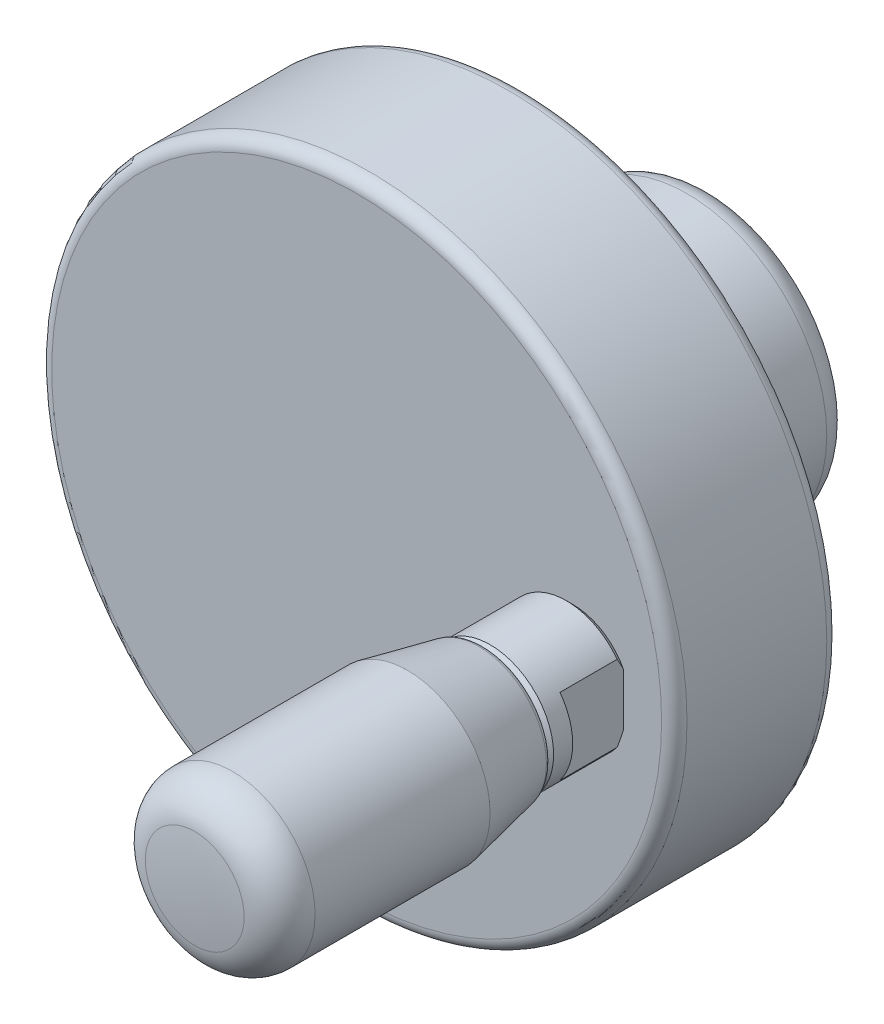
ISO-10303-21;
HEADER;
FILE_DESCRIPTION(('STEP AP214'),'2;1');
FILE_NAME('part.step','',(''),(''),'','','');
FILE_SCHEMA(('AUTOMOTIVE_DESIGN { 1 0 10303 214 1 1 1 1 }'));
ENDSEC;
DATA;
#1=APPLICATION_CONTEXT('core data for automotive mechanical design processes');
#2=APPLICATION_PROTOCOL_DEFINITION('international standard','automotive_design',2000,#1);
#3=PRODUCT_CONTEXT('',#1,'mechanical');
#4=PRODUCT('Part','Part','',(#3));
#5=PRODUCT_RELATED_PRODUCT_CATEGORY('part','',(#4));
#6=PRODUCT_DEFINITION_FORMATION('','',#4);
#7=PRODUCT_DEFINITION_CONTEXT('part definition',#1,'design');
#8=PRODUCT_DEFINITION('design','',#6,#7);
#9=PRODUCT_DEFINITION_SHAPE('','',#8);
#10=(LENGTH_UNIT() NAMED_UNIT(*) SI_UNIT(.MILLI.,.METRE.));
#11=(NAMED_UNIT(*) PLANE_ANGLE_UNIT() SI_UNIT($,.RADIAN.));
#12=(NAMED_UNIT(*) SI_UNIT($,.STERADIAN.) SOLID_ANGLE_UNIT());
#13=UNCERTAINTY_MEASURE_WITH_UNIT(LENGTH_MEASURE(1.E-05),#10,'distance_accuracy_value','');
#14=(GEOMETRIC_REPRESENTATION_CONTEXT(3) GLOBAL_UNCERTAINTY_ASSIGNED_CONTEXT((#13)) GLOBAL_UNIT_ASSIGNED_CONTEXT((#10,
#11,#12)) REPRESENTATION_CONTEXT('',''));
#15=CARTESIAN_POINT('',(0.,0.,0.));
#16=DIRECTION('',(0.,0.,1.));
#17=DIRECTION('',(1.,0.,0.));
#18=AXIS2_PLACEMENT_3D('',#15,#16,#17);
#19=CARTESIAN_POINT('',(0.,2.5,15.));
#20=DIRECTION('',(0.,0.,1.));
#21=DIRECTION('',(1.,0.,0.));
#22=AXIS2_PLACEMENT_3D('',#19,#20,#21);
#23=PLANE('',#22);
#24=CARTESIAN_POINT('',(0.,0.,15.));
#25=DIRECTION('',(0.,0.,1.));
#26=DIRECTION('',(1.,0.,0.));
#27=AXIS2_PLACEMENT_3D('',#24,#25,#26);
#28=CIRCLE('',#27,2.5);
#29=CARTESIAN_POINT('',(2.5,0.,15.));
#30=VERTEX_POINT('',#29);
#31=EDGE_CURVE('E79',#30,#30,#28,.T.);
#32=ORIENTED_EDGE('',*,*,#31,.F.);
#33=EDGE_LOOP('',(#32));
#34=FACE_BOUND('',#33,.T.);
#35=ADVANCED_FACE('F14',(#34),#23,.F.);
#36=CARTESIAN_POINT('',(0.,0.,33.));
#37=DIRECTION('',(0.,0.,1.));
#38=DIRECTION('',(1.,0.,0.));
#39=AXIS2_PLACEMENT_3D('',#36,#37,#38);
#40=CYLINDRICAL_SURFACE('',#39,2.5);
#41=CARTESIAN_POINT('',(0.,0.,0.));
#42=DIRECTION('',(0.,0.,1.));
#43=DIRECTION('',(1.,0.,0.));
#44=AXIS2_PLACEMENT_3D('',#41,#42,#43);
#45=CIRCLE('',#44,2.5);
#46=CARTESIAN_POINT('',(2.5,0.,0.));
#47=VERTEX_POINT('',#46);
#48=EDGE_CURVE('E182',#47,#47,#45,.T.);
#49=ORIENTED_EDGE('',*,*,#48,.F.);
#50=EDGE_LOOP('',(#49));
#51=FACE_BOUND('',#50,.T.);
#52=ORIENTED_EDGE('',*,*,#31,.T.);
#53=EDGE_LOOP('',(#52));
#54=FACE_BOUND('',#53,.T.);
#55=ADVANCED_FACE('F214',(#51,#54),#40,.F.);
#56=CARTESIAN_POINT('',(0.,9.,0.));
#57=DIRECTION('',(0.,0.,1.));
#58=DIRECTION('',(1.,0.,0.));
#59=AXIS2_PLACEMENT_3D('',#56,#57,#58);
#60=PLANE('',#59);
#61=CARTESIAN_POINT('',(0.,0.,0.));
#62=DIRECTION('',(0.,0.,1.));
#63=DIRECTION('',(1.,0.,0.));
#64=AXIS2_PLACEMENT_3D('',#61,#62,#63);
#65=CIRCLE('',#64,9.);
#66=CARTESIAN_POINT('',(9.,0.,0.));
#67=VERTEX_POINT('',#66);
#68=EDGE_CURVE('E179',#67,#67,#65,.T.);
#69=ORIENTED_EDGE('',*,*,#68,.F.);
#70=EDGE_LOOP('',(#69));
#71=FACE_BOUND('',#70,.T.);
#72=ORIENTED_EDGE('',*,*,#48,.T.);
#73=EDGE_LOOP('',(#72));
#74=FACE_BOUND('',#73,.T.);
#75=ADVANCED_FACE('F220',(#71,#74),#60,.F.);
#76=CARTESIAN_POINT('',(0.,0.,2.));
#77=DIRECTION('',(0.,0.,1.));
#78=DIRECTION('',(1.,0.,0.));
#79=AXIS2_PLACEMENT_3D('',#76,#77,#78);
#80=TOROIDAL_SURFACE('',#79,9.,2.);
#81=CARTESIAN_POINT('',(0.,0.,2.));
#82=DIRECTION('',(0.,0.,1.));
#83=DIRECTION('',(1.,0.,0.));
#84=AXIS2_PLACEMENT_3D('',#81,#82,#83);
#85=CIRCLE('',#84,11.);
#86=CARTESIAN_POINT('',(11.,0.,2.));
#87=VERTEX_POINT('',#86);
#88=EDGE_CURVE('E176',#87,#87,#85,.T.);
#89=ORIENTED_EDGE('',*,*,#88,.F.);
#90=EDGE_LOOP('',(#89));
#91=FACE_BOUND('',#90,.T.);
#92=ORIENTED_EDGE('',*,*,#68,.T.);
#93=EDGE_LOOP('',(#92));
#94=FACE_BOUND('',#93,.T.);
#95=ADVANCED_FACE('F228',(#91,#94),#80,.T.);
#96=CARTESIAN_POINT('',(0.,0.,33.));
#97=DIRECTION('',(0.,0.,1.));
#98=DIRECTION('',(1.,0.,0.));
#99=AXIS2_PLACEMENT_3D('',#96,#97,#98);
#100=CYLINDRICAL_SURFACE('',#99,11.);
#101=CARTESIAN_POINT('',(0.,0.,12.));
#102=DIRECTION('',(0.,0.,1.));
#103=DIRECTION('',(1.,0.,0.));
#104=AXIS2_PLACEMENT_3D('',#101,#102,#103);
#105=CIRCLE('',#104,11.);
#106=CARTESIAN_POINT('',(11.,0.,12.));
#107=VERTEX_POINT('',#106);
#108=EDGE_CURVE('E173',#107,#107,#105,.T.);
#109=ORIENTED_EDGE('',*,*,#108,.F.);
#110=EDGE_LOOP('',(#109));
#111=FACE_BOUND('',#110,.T.);
#112=ORIENTED_EDGE('',*,*,#88,.T.);
#113=EDGE_LOOP('',(#112));
#114=FACE_BOUND('',#113,.T.);
#115=ADVANCED_FACE('F235',(#111,#114),#100,.T.);
#116=CARTESIAN_POINT('',(0.,0.,12.));
#117=DIRECTION('',(0.,0.,1.));
#118=DIRECTION('',(1.,0.,0.));
#119=AXIS2_PLACEMENT_3D('',#116,#117,#118);
#120=TOROIDAL_SURFACE('',#119,14.,3.);
#121=CARTESIAN_POINT('',(0.,0.,15.));
#122=DIRECTION('',(0.,0.,1.));
#123=DIRECTION('',(1.,0.,0.));
#124=AXIS2_PLACEMENT_3D('',#121,#122,#123);
#125=CIRCLE('',#124,14.);
#126=CARTESIAN_POINT('',(14.,0.,15.));
#127=VERTEX_POINT('',#126);
#128=EDGE_CURVE('E170',#127,#127,#125,.T.);
#129=ORIENTED_EDGE('',*,*,#128,.F.);
#130=EDGE_LOOP('',(#129));
#131=FACE_BOUND('',#130,.T.);
#132=ORIENTED_EDGE('',*,*,#108,.T.);
#133=EDGE_LOOP('',(#132));
#134=FACE_BOUND('',#133,.T.);
#135=ADVANCED_FACE('F239',(#131,#134),#120,.F.);
#136=CARTESIAN_POINT('',(0.,24.,15.));
#137=DIRECTION('',(0.,0.,1.));
#138=DIRECTION('',(1.,0.,0.));
#139=AXIS2_PLACEMENT_3D('',#136,#137,#138);
#140=PLANE('',#139);
#141=CARTESIAN_POINT('',(0.,0.,15.));
#142=DIRECTION('',(0.,0.,1.));
#143=DIRECTION('',(1.,0.,0.));
#144=AXIS2_PLACEMENT_3D('',#141,#142,#143);
#145=CIRCLE('',#144,24.);
#146=CARTESIAN_POINT('',(24.,0.,15.));
#147=VERTEX_POINT('',#146);
#148=EDGE_CURVE('E167',#147,#147,#145,.T.);
#149=ORIENTED_EDGE('',*,*,#148,.F.);
#150=EDGE_LOOP('',(#149));
#151=FACE_BOUND('',#150,.T.);
#152=ORIENTED_EDGE('',*,*,#128,.T.);
#153=EDGE_LOOP('',(#152));
#154=FACE_BOUND('',#153,.T.);
#155=ADVANCED_FACE('F243',(#151,#154),#140,.F.);
#156=CARTESIAN_POINT('',(0.,0.,16.));
#157=DIRECTION('',(0.,0.,1.));
#158=DIRECTION('',(1.,0.,0.));
#159=AXIS2_PLACEMENT_3D('',#156,#157,#158);
#160=TOROIDAL_SURFACE('',#159,24.,1.00000000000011);
#161=CARTESIAN_POINT('',(0.,0.,16.));
#162=DIRECTION('',(0.,0.,1.));
#163=DIRECTION('',(1.,0.,0.));
#164=AXIS2_PLACEMENT_3D('',#161,#162,#163);
#165=CIRCLE('',#164,25.);
#166=CARTESIAN_POINT('',(25.,0.,16.));
#167=VERTEX_POINT('',#166);
#168=EDGE_CURVE('E162',#167,#167,#165,.T.);
#169=ORIENTED_EDGE('',*,*,#168,.F.);
#170=EDGE_LOOP('',(#169));
#171=FACE_BOUND('',#170,.T.);
#172=ORIENTED_EDGE('',*,*,#148,.T.);
#173=EDGE_LOOP('',(#172));
#174=FACE_BOUND('',#173,.T.);
#175=ADVANCED_FACE('F247',(#171,#174),#160,.T.);
#176=CARTESIAN_POINT('',(0.,0.,33.));
#177=DIRECTION('',(0.,0.,1.));
#178=DIRECTION('',(1.,0.,0.));
#179=AXIS2_PLACEMENT_3D('',#176,#177,#178);
#180=CYLINDRICAL_SURFACE('',#179,25.);
#181=CARTESIAN_POINT('',(0.,0.,27.));
#182=DIRECTION('',(0.,0.,1.));
#183=DIRECTION('',(1.,0.,0.));
#184=AXIS2_PLACEMENT_3D('',#181,#182,#183);
#185=CIRCLE('',#184,25.);
#186=CARTESIAN_POINT('',(25.,0.,27.));
#187=VERTEX_POINT('',#186);
#188=EDGE_CURVE('E158',#187,#187,#185,.T.);
#189=ORIENTED_EDGE('',*,*,#188,.F.);
#190=EDGE_LOOP('',(#189));
#191=FACE_BOUND('',#190,.T.);
#192=ORIENTED_EDGE('',*,*,#168,.T.);
#193=EDGE_LOOP('',(#192));
#194=FACE_BOUND('',#193,.T.);
#195=ADVANCED_FACE('F251',(#191,#194),#180,.T.);
#196=CARTESIAN_POINT('',(0.,0.,27.));
#197=DIRECTION('',(0.,0.,1.));
#198=DIRECTION('',(1.,0.,0.));
#199=AXIS2_PLACEMENT_3D('',#196,#197,#198);
#200=TOROIDAL_SURFACE('',#199,24.,0.999999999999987);
#201=CARTESIAN_POINT('',(0.,0.,28.));
#202=DIRECTION('',(0.,0.,1.));
#203=DIRECTION('',(1.,0.,0.));
#204=AXIS2_PLACEMENT_3D('',#201,#202,#203);
#205=CIRCLE('',#204,24.);
#206=CARTESIAN_POINT('',(24.,0.,28.));
#207=VERTEX_POINT('',#206);
#208=EDGE_CURVE('E156',#207,#207,#205,.T.);
#209=ORIENTED_EDGE('',*,*,#208,.F.);
#210=EDGE_LOOP('',(#209));
#211=FACE_BOUND('',#210,.T.);
#212=ORIENTED_EDGE('',*,*,#188,.T.);
#213=EDGE_LOOP('',(#212));
#214=FACE_BOUND('',#213,.T.);
#215=ADVANCED_FACE('F255',(#211,#214),#200,.T.);
#216=CARTESIAN_POINT('',(0.,24.,28.));
#217=DIRECTION('',(0.,0.,-1.));
#218=DIRECTION('',(-1.,0.,0.));
#219=AXIS2_PLACEMENT_3D('',#216,#217,#218);
#220=PLANE('',#219);
#221=CARTESIAN_POINT('',(17.,0.,28.));
#222=DIRECTION('',(0.,0.,-1.));
#223=DIRECTION('',(0.,1.,0.));
#224=AXIS2_PLACEMENT_3D('',#221,#222,#223);
#225=CIRCLE('',#224,4.5);
#226=CARTESIAN_POINT('',(21.,2.06155281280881,28.));
#227=VERTEX_POINT('',#226);
#228=CARTESIAN_POINT('',(13.,2.06155281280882,28.));
#229=VERTEX_POINT('',#228);
#230=EDGE_CURVE('E24',#227,#229,#225,.F.);
#231=ORIENTED_EDGE('',*,*,#230,.F.);
#232=DIRECTION('',(0.,-1.,0.));
#233=VECTOR('',#232,1.);
#234=CARTESIAN_POINT('',(21.,24.,28.));
#235=LINE('',#234,#233);
#236=CARTESIAN_POINT('',(21.,-2.06155281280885,28.));
#237=VERTEX_POINT('',#236);
#238=EDGE_CURVE('E9',#227,#237,#235,.T.);
#239=ORIENTED_EDGE('',*,*,#238,.T.);
#240=CARTESIAN_POINT('',(17.,0.,28.));
#241=DIRECTION('',(0.,0.,-1.));
#242=DIRECTION('',(0.,1.,0.));
#243=AXIS2_PLACEMENT_3D('',#240,#241,#242);
#244=CIRCLE('',#243,4.5);
#245=CARTESIAN_POINT('',(13.,-2.06155281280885,28.));
#246=VERTEX_POINT('',#245);
#247=EDGE_CURVE('E71',#246,#237,#244,.F.);
#248=ORIENTED_EDGE('',*,*,#247,.F.);
#249=DIRECTION('',(0.,1.,0.));
#250=VECTOR('',#249,1.);
#251=CARTESIAN_POINT('',(13.,24.,28.));
#252=LINE('',#251,#250);
#253=EDGE_CURVE('E73',#246,#229,#252,.T.);
#254=ORIENTED_EDGE('',*,*,#253,.T.);
#255=EDGE_LOOP('',(#231,#239,#248,#254));
#256=FACE_BOUND('',#255,.T.);
#257=ORIENTED_EDGE('',*,*,#208,.T.);
#258=EDGE_LOOP('',(#257));
#259=FACE_BOUND('',#258,.T.);
#260=ADVANCED_FACE('F74',(#256,#259),#220,.F.);
#261=CARTESIAN_POINT('',(17.,0.,28.));
#262=DIRECTION('',(0.,0.,1.));
#263=DIRECTION('',(0.,1.,0.));
#264=AXIS2_PLACEMENT_3D('',#261,#262,#263);
#265=SPHERICAL_SURFACE('',#264,30.);
#266=CARTESIAN_POINT('',(17.,0.,57.7468745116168));
#267=DIRECTION('',(0.,0.,1.));
#268=DIRECTION('',(1.,0.,0.));
#269=AXIS2_PLACEMENT_3D('',#266,#267,#268);
#270=CIRCLE('',#269,3.88888888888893);
#271=CARTESIAN_POINT('',(20.8888888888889,0.,57.7468745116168));
#272=VERTEX_POINT('',#271);
#273=EDGE_CURVE('E129',#272,#272,#270,.T.);
#274=ORIENTED_EDGE('',*,*,#273,.T.);
#275=EDGE_LOOP('',(#274));
#276=FACE_BOUND('',#275,.T.);
#277=ADVANCED_FACE('F16',(#276),#265,.T.);
#278=CARTESIAN_POINT('',(17.,0.,54.7721870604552));
#279=DIRECTION('',(0.,0.,1.));
#280=DIRECTION('',(1.,0.,0.));
#281=AXIS2_PLACEMENT_3D('',#278,#279,#280);
#282=TOROIDAL_SURFACE('',#281,3.5,3.);
#283=ORIENTED_EDGE('',*,*,#273,.F.);
#284=EDGE_LOOP('',(#283));
#285=FACE_BOUND('',#284,.T.);
#286=CARTESIAN_POINT('',(17.,0.,54.7721870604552));
#287=DIRECTION('',(0.,0.,1.));
#288=DIRECTION('',(1.,0.,0.));
#289=AXIS2_PLACEMENT_3D('',#286,#287,#288);
#290=CIRCLE('',#289,6.5);
#291=CARTESIAN_POINT('',(23.5,0.,54.7721870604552));
#292=VERTEX_POINT('',#291);
#293=EDGE_CURVE('E132',#292,#292,#290,.T.);
#294=ORIENTED_EDGE('',*,*,#293,.T.);
#295=EDGE_LOOP('',(#294));
#296=FACE_BOUND('',#295,.T.);
#297=ADVANCED_FACE('F201',(#285,#296),#282,.T.);
#298=CARTESIAN_POINT('',(17.,0.,60.5));
#299=DIRECTION('',(0.,0.,1.));
#300=DIRECTION('',(1.,0.,0.));
#301=AXIS2_PLACEMENT_3D('',#298,#299,#300);
#302=CYLINDRICAL_SURFACE('',#301,6.5);
#303=ORIENTED_EDGE('',*,*,#293,.F.);
#304=EDGE_LOOP('',(#303));
#305=FACE_BOUND('',#304,.T.);
#306=CARTESIAN_POINT('',(17.,0.,41.));
#307=DIRECTION('',(0.,0.,1.));
#308=DIRECTION('',(1.,0.,0.));
#309=AXIS2_PLACEMENT_3D('',#306,#307,#308);
#310=CIRCLE('',#309,6.5);
#311=CARTESIAN_POINT('',(23.5,0.,41.));
#312=VERTEX_POINT('',#311);
#313=EDGE_CURVE('E135',#312,#312,#310,.T.);
#314=ORIENTED_EDGE('',*,*,#313,.T.);
#315=EDGE_LOOP('',(#314));
#316=FACE_BOUND('',#315,.T.);
#317=ADVANCED_FACE('F211',(#305,#316),#302,.T.);
#318=CARTESIAN_POINT('',(17.,0.,35.398022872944));
#319=DIRECTION('',(0.,0.,1.));
#320=DIRECTION('',(1.,0.,0.));
#321=AXIS2_PLACEMENT_3D('',#318,#319,#320);
#322=CONICAL_SURFACE('',#321,5.33292143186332,0.20539538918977);
#323=ORIENTED_EDGE('',*,*,#313,.F.);
#324=EDGE_LOOP('',(#323));
#325=FACE_BOUND('',#324,.T.);
#326=CARTESIAN_POINT('',(17.,0.,35.398022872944));
#327=DIRECTION('',(0.,0.,1.));
#328=DIRECTION('',(1.,0.,0.));
#329=AXIS2_PLACEMENT_3D('',#326,#327,#328);
#330=CIRCLE('',#329,5.33292143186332);
#331=CARTESIAN_POINT('',(22.3329214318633,0.,35.398022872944));
#332=VERTEX_POINT('',#331);
#333=EDGE_CURVE('E138',#332,#332,#330,.T.);
#334=ORIENTED_EDGE('',*,*,#333,.T.);
#335=EDGE_LOOP('',(#334));
#336=FACE_BOUND('',#335,.T.);
#337=ADVANCED_FACE('F283',(#325,#336),#322,.T.);
#338=CARTESIAN_POINT('',(17.,0.,35.5));
#339=DIRECTION('',(0.,0.,1.));
#340=DIRECTION('',(1.,0.,0.));
#341=AXIS2_PLACEMENT_3D('',#338,#339,#340);
#342=TOROIDAL_SURFACE('',#341,4.84343122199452,0.500000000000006);
#343=ORIENTED_EDGE('',*,*,#333,.F.);
#344=EDGE_LOOP('',(#343));
#345=FACE_BOUND('',#344,.T.);
#346=CARTESIAN_POINT('',(17.,0.,35.));
#347=DIRECTION('',(0.,0.,1.));
#348=DIRECTION('',(1.,0.,0.));
#349=AXIS2_PLACEMENT_3D('',#346,#347,#348);
#350=CIRCLE('',#349,4.84343122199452);
#351=CARTESIAN_POINT('',(21.8434312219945,0.,35.));
#352=VERTEX_POINT('',#351);
#353=EDGE_CURVE('E141',#352,#352,#350,.T.);
#354=ORIENTED_EDGE('',*,*,#353,.T.);
#355=EDGE_LOOP('',(#354));
#356=FACE_BOUND('',#355,.T.);
#357=ADVANCED_FACE('F279',(#345,#356),#342,.T.);
#358=CARTESIAN_POINT('',(17.,4.84343122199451,35.));
#359=DIRECTION('',(0.,0.,1.));
#360=DIRECTION('',(1.,0.,0.));
#361=AXIS2_PLACEMENT_3D('',#358,#359,#360);
#362=PLANE('',#361);
#363=ORIENTED_EDGE('',*,*,#353,.F.);
#364=EDGE_LOOP('',(#363));
#365=FACE_BOUND('',#364,.T.);
#366=CARTESIAN_POINT('',(17.,0.,35.));
#367=DIRECTION('',(0.,0.,1.));
#368=DIRECTION('',(1.,0.,0.));
#369=AXIS2_PLACEMENT_3D('',#366,#367,#368);
#370=CIRCLE('',#369,4.49999999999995);
#371=CARTESIAN_POINT('',(21.5,0.,35.));
#372=VERTEX_POINT('',#371);
#373=EDGE_CURVE('E144',#372,#372,#370,.T.);
#374=ORIENTED_EDGE('',*,*,#373,.T.);
#375=EDGE_LOOP('',(#374));
#376=FACE_BOUND('',#375,.T.);
#377=ADVANCED_FACE('F207',(#365,#376),#362,.F.);
#378=CARTESIAN_POINT('',(17.,0.,34.5));
#379=DIRECTION('',(0.,0.,-1.));
#380=DIRECTION('',(-1.,0.,0.));
#381=AXIS2_PLACEMENT_3D('',#378,#379,#380);
#382=CONICAL_SURFACE('',#381,5.,0.785398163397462);
#383=ORIENTED_EDGE('',*,*,#373,.F.);
#384=EDGE_LOOP('',(#383));
#385=FACE_BOUND('',#384,.T.);
#386=CARTESIAN_POINT('',(17.,0.,34.5));
#387=DIRECTION('',(0.,0.,1.));
#388=DIRECTION('',(1.,0.,0.));
#389=AXIS2_PLACEMENT_3D('',#386,#387,#388);
#390=CIRCLE('',#389,5.);
#391=CARTESIAN_POINT('',(22.,0.,34.5));
#392=VERTEX_POINT('',#391);
#393=EDGE_CURVE('E147',#392,#392,#390,.T.);
#394=ORIENTED_EDGE('',*,*,#393,.T.);
#395=EDGE_LOOP('',(#394));
#396=FACE_BOUND('',#395,.T.);
#397=ADVANCED_FACE('F200',(#385,#396),#382,.T.);
#398=CARTESIAN_POINT('',(21.,3.,33.));
#399=DIRECTION('',(0.,0.,1.));
#400=DIRECTION('',(1.,0.,0.));
#401=AXIS2_PLACEMENT_3D('',#398,#399,#400);
#402=PLANE('',#401);
#403=CARTESIAN_POINT('',(17.,0.,33.));
#404=DIRECTION('',(0.,0.,1.));
#405=DIRECTION('',(1.,0.,0.));
#406=AXIS2_PLACEMENT_3D('',#403,#404,#405);
#407=CIRCLE('',#406,5.);
#408=CARTESIAN_POINT('',(21.,-3.,33.));
#409=VERTEX_POINT('',#408);
#410=CARTESIAN_POINT('',(21.,3.,33.));
#411=VERTEX_POINT('',#410);
#412=EDGE_CURVE('E153',#409,#411,#407,.T.);
#413=ORIENTED_EDGE('',*,*,#412,.F.);
#414=DIRECTION('',(0.,-1.,0.));
#415=VECTOR('',#414,1.);
#416=CARTESIAN_POINT('',(21.,3.,33.));
#417=LINE('',#416,#415);
#418=EDGE_CURVE('E61',#411,#409,#417,.T.);
#419=ORIENTED_EDGE('',*,*,#418,.F.);
#420=EDGE_LOOP('',(#413,#419));
#421=FACE_BOUND('',#420,.T.);
#422=ADVANCED_FACE('F117',(#421),#402,.F.);
#423=CARTESIAN_POINT('',(13.,3.,33.));
#424=DIRECTION('',(0.,0.,-1.));
#425=DIRECTION('',(-1.,0.,0.));
#426=AXIS2_PLACEMENT_3D('',#423,#424,#425);
#427=PLANE('',#426);
#428=CARTESIAN_POINT('',(17.,0.,33.));
#429=DIRECTION('',(0.,0.,-1.));
#430=DIRECTION('',(-1.,0.,0.));
#431=AXIS2_PLACEMENT_3D('',#428,#429,#430);
#432=CIRCLE('',#431,5.);
#433=CARTESIAN_POINT('',(13.,-3.,33.));
#434=VERTEX_POINT('',#433);
#435=CARTESIAN_POINT('',(13.,2.99999999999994,33.));
#436=VERTEX_POINT('',#435);
#437=EDGE_CURVE('E67',#434,#436,#432,.T.);
#438=ORIENTED_EDGE('',*,*,#437,.T.);
#439=DIRECTION('',(0.,-1.,0.));
#440=VECTOR('',#439,1.);
#441=CARTESIAN_POINT('',(13.,3.,33.));
#442=LINE('',#441,#440);
#443=EDGE_CURVE('E187',#436,#434,#442,.T.);
#444=ORIENTED_EDGE('',*,*,#443,.T.);
#445=EDGE_LOOP('',(#438,#444));
#446=FACE_BOUND('',#445,.T.);
#447=ADVANCED_FACE('F112',(#446),#427,.T.);
#448=CARTESIAN_POINT('',(17.,0.,60.5));
#449=DIRECTION('',(0.,0.,1.));
#450=DIRECTION('',(1.,0.,0.));
#451=AXIS2_PLACEMENT_3D('',#448,#449,#450);
#452=CYLINDRICAL_SURFACE('',#451,5.);
#453=ORIENTED_EDGE('',*,*,#393,.F.);
#454=EDGE_LOOP('',(#453));
#455=FACE_BOUND('',#454,.T.);
#456=DIRECTION('',(0.,0.,1.));
#457=VECTOR('',#456,1.);
#458=CARTESIAN_POINT('',(13.,2.99999999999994,60.5));
#459=LINE('',#458,#457);
#460=CARTESIAN_POINT('',(13.,3.,28.5));
#461=VERTEX_POINT('',#460);
#462=EDGE_CURVE('E18',#436,#461,#459,.F.);
#463=ORIENTED_EDGE('',*,*,#462,.F.);
#464=ORIENTED_EDGE('',*,*,#437,.F.);
#465=DIRECTION('',(0.,0.,-1.));
#466=VECTOR('',#465,1.);
#467=CARTESIAN_POINT('',(13.,-3.,28.));
#468=LINE('',#467,#466);
#469=CARTESIAN_POINT('',(13.,-3.,28.5));
#470=VERTEX_POINT('',#469);
#471=EDGE_CURVE('E96',#434,#470,#468,.T.);
#472=ORIENTED_EDGE('',*,*,#471,.T.);
#473=CARTESIAN_POINT('',(17.,0.,28.5));
#474=DIRECTION('',(0.,0.,1.));
#475=DIRECTION('',(1.,0.,0.));
#476=AXIS2_PLACEMENT_3D('',#473,#474,#475);
#477=CIRCLE('',#476,5.);
#478=CARTESIAN_POINT('',(21.,-3.,28.5));
#479=VERTEX_POINT('',#478);
#480=EDGE_CURVE('E150',#470,#479,#477,.T.);
#481=ORIENTED_EDGE('',*,*,#480,.T.);
#482=DIRECTION('',(0.,0.,-1.));
#483=VECTOR('',#482,1.);
#484=CARTESIAN_POINT('',(21.,-3.,33.));
#485=LINE('',#484,#483);
#486=EDGE_CURVE('E94',#409,#479,#485,.T.);
#487=ORIENTED_EDGE('',*,*,#486,.F.);
#488=ORIENTED_EDGE('',*,*,#412,.T.);
#489=DIRECTION('',(0.,0.,1.));
#490=VECTOR('',#489,1.);
#491=CARTESIAN_POINT('',(21.,2.99999999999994,60.5));
#492=LINE('',#491,#490);
#493=CARTESIAN_POINT('',(21.,3.,28.5));
#494=VERTEX_POINT('',#493);
#495=EDGE_CURVE('E155',#494,#411,#492,.T.);
#496=ORIENTED_EDGE('',*,*,#495,.F.);
#497=EDGE_CURVE('E151',#494,#461,#477,.T.);
#498=ORIENTED_EDGE('',*,*,#497,.T.);
#499=EDGE_LOOP('',(#463,#464,#472,#481,#487,#488,#496,#498));
#500=FACE_BOUND('',#499,.T.);
#501=ADVANCED_FACE('F116',(#455,#500),#452,.T.);
#502=CARTESIAN_POINT('',(17.,0.,28.));
#503=DIRECTION('',(0.,0.,1.));
#504=DIRECTION('',(1.,0.,0.));
#505=AXIS2_PLACEMENT_3D('',#502,#503,#504);
#506=CONICAL_SURFACE('',#505,4.5,0.785398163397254);
#507=CARTESIAN_POINT('',(13.,6.61267837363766,31.2283578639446));
#508=CARTESIAN_POINT('',(13.,6.5138484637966,31.1437976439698));
#509=CARTESIAN_POINT('',(13.,6.41477027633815,31.0595275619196));
#510=CARTESIAN_POINT('',(13.,6.21605204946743,30.8916487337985));
#511=CARTESIAN_POINT('',(13.,6.11641199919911,30.8080400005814));
#512=CARTESIAN_POINT('',(13.,5.81645670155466,30.5582489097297));
#513=CARTESIAN_POINT('',(13.,5.61520522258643,30.3931865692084));
#514=CARTESIAN_POINT('',(13.,5.20414443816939,30.0626045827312));
#515=CARTESIAN_POINT('',(13.,4.99425007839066,29.8971902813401));
#516=CARTESIAN_POINT('',(13.,4.57024237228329,29.5719522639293));
#517=CARTESIAN_POINT('',(13.,4.35613010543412,29.4121271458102));
#518=CARTESIAN_POINT('',(13.,3.92191769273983,29.0998698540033));
#519=CARTESIAN_POINT('',(13.,3.70180729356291,28.9474517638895));
#520=CARTESIAN_POINT('',(13.,3.36602267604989,28.7271432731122));
#521=CARTESIAN_POINT('',(13.,3.25310127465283,28.655060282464));
#522=CARTESIAN_POINT('',(13.,3.02514651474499,28.514324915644));
#523=CARTESIAN_POINT('',(13.,2.91011332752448,28.4456722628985));
#524=CARTESIAN_POINT('',(13.,2.67874926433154,28.3131895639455));
#525=CARTESIAN_POINT('',(13.,2.56244159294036,28.2493194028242));
#526=CARTESIAN_POINT('',(13.,2.32719948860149,28.1266386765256));
#527=CARTESIAN_POINT('',(13.,2.20826475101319,28.0678287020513));
#528=CARTESIAN_POINT('',(13.,1.847452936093,27.9008663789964));
#529=CARTESIAN_POINT('',(13.,1.60104963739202,27.8018732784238));
#530=CARTESIAN_POINT('',(13.,1.21869368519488,27.6797214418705));
#531=CARTESIAN_POINT('',(13.,1.08703991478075,27.6430541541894));
#532=CARTESIAN_POINT('',(13.,0.820997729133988,27.5813368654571));
#533=CARTESIAN_POINT('',(13.,0.686609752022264,27.556285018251));
#534=CARTESIAN_POINT('',(13.,0.416637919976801,27.5194288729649));
#535=CARTESIAN_POINT('',(13.,0.281062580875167,27.5075632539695));
#536=CARTESIAN_POINT('',(13.,0.0094016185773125,27.4977080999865));
#537=CARTESIAN_POINT('',(13.,-0.126683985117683,27.4997180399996));
#538=CARTESIAN_POINT('',(13.,-0.39769597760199,27.5174494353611));
#539=CARTESIAN_POINT('',(13.,-0.532623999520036,27.5331464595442));
#540=CARTESIAN_POINT('',(13.,-0.80039046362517,27.5771511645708));
#541=CARTESIAN_POINT('',(13.,-0.933228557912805,27.6054609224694));
#542=CARTESIAN_POINT('',(13.,-1.19683850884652,27.6732578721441));
#543=CARTESIAN_POINT('',(13.,-1.32759286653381,27.712812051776));
#544=CARTESIAN_POINT('',(13.,-1.58587707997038,27.8011944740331));
#545=CARTESIAN_POINT('',(13.,-1.71340705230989,27.8500223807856));
#546=CARTESIAN_POINT('',(13.,-2.00607339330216,27.9722871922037));
#547=CARTESIAN_POINT('',(13.,-2.17001221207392,28.0485725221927));
#548=CARTESIAN_POINT('',(13.,-2.49288824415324,28.2111596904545));
#549=CARTESIAN_POINT('',(13.,-2.65182228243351,28.2974677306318));
#550=CARTESIAN_POINT('',(13.,-2.96566951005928,28.4778181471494));
#551=CARTESIAN_POINT('',(13.,-3.12057308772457,28.5718771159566));
#552=CARTESIAN_POINT('',(13.,-3.42666836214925,28.7657420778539));
#553=CARTESIAN_POINT('',(13.,-3.57786085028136,28.8655468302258));
#554=CARTESIAN_POINT('',(13.,-3.87789023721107,29.0700932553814));
#555=CARTESIAN_POINT('',(13.,-4.02671282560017,29.1748558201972));
#556=CARTESIAN_POINT('',(13.,-4.32180408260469,29.3879178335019));
#557=CARTESIAN_POINT('',(13.,-4.46807264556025,29.496217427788));
#558=CARTESIAN_POINT('',(13.,-4.75830471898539,29.7154998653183));
#559=CARTESIAN_POINT('',(13.,-4.90227076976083,29.8264793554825));
#560=CARTESIAN_POINT('',(13.,-5.18842229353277,30.050713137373));
#561=CARTESIAN_POINT('',(13.,-5.33060772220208,30.1639674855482));
#562=CARTESIAN_POINT('',(13.,-5.66527129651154,30.4341347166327));
#563=CARTESIAN_POINT('',(13.,-5.85710121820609,30.5918491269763));
#564=CARTESIAN_POINT('',(13.,-6.23712174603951,30.9088482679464));
#565=CARTESIAN_POINT('',(13.,-6.42532862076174,31.0681134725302));
#566=CARTESIAN_POINT('',(13.,-6.61267837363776,31.2283578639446));
#567=B_SPLINE_CURVE_WITH_KNOTS('',3,(#507,#508,#509,#510,#511,#512,#513,#514,#515,#516,#517,
#518,#519,#520,#521,#522,#523,#524,#525,#526,#527,#528,#529,#530,#531,#532,#533,#534,#535,#536,
#537,#538,#539,#540,#541,#542,#543,#544,#545,#546,#547,#548,#549,#550,#551,#552,#553,#554,#555,
#556,#557,#558,#559,#560,#561,#562,#563,#564,#565,#566),.UNSPECIFIED.,.F.,.F.,(4,2,2,2,2,2,2,2,
2,2,2,2,2,2,2,2,2,2,2,2,2,2,2,2,2,2,2,2,2,4),(0.,0.390204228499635,0.780416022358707,
1.56123065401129,2.36288213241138,3.16433104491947,3.96724854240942,4.36910117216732,
4.77092134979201,5.16886742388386,5.56685988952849,6.36104037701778,6.77061720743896,
7.18012891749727,7.58772816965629,7.99531199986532,8.40216978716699,8.80909460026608,
9.21849635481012,9.62788328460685,10.1698609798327,10.7121758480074,11.2556834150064,
11.7990740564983,12.3450041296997,12.8909567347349,13.4362584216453,13.9815736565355,
14.7265631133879,15.4661801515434),.UNSPECIFIED.);
#568=EDGE_CURVE('E92',#246,#470,#567,.T.);
#569=ORIENTED_EDGE('',*,*,#568,.F.);
#570=ORIENTED_EDGE('',*,*,#247,.T.);
#571=CARTESIAN_POINT('',(21.,-6.61267837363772,31.2283578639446));
#572=CARTESIAN_POINT('',(21.,-6.51384846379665,31.1437976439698));
#573=CARTESIAN_POINT('',(21.,-6.4147702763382,31.0595275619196));
#574=CARTESIAN_POINT('',(21.,-6.21605204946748,30.8916487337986));
#575=CARTESIAN_POINT('',(21.,-6.11641199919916,30.8080400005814));
#576=CARTESIAN_POINT('',(21.,-5.81645670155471,30.5582489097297));
#577=CARTESIAN_POINT('',(21.,-5.61520522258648,30.3931865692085));
#578=CARTESIAN_POINT('',(21.,-5.20414443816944,30.0626045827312));
#579=CARTESIAN_POINT('',(21.,-4.99425007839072,29.8971902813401));
#580=CARTESIAN_POINT('',(21.,-4.57024237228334,29.5719522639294));
#581=CARTESIAN_POINT('',(21.,-4.35613010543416,29.4121271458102));
#582=CARTESIAN_POINT('',(21.,-3.92191769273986,29.0998698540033));
#583=CARTESIAN_POINT('',(21.,-3.70180729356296,28.9474517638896));
#584=CARTESIAN_POINT('',(21.,-3.36602267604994,28.7271432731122));
#585=CARTESIAN_POINT('',(21.,-3.25310127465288,28.655060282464));
#586=CARTESIAN_POINT('',(21.,-3.02514651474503,28.514324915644));
#587=CARTESIAN_POINT('',(21.,-2.91011332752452,28.4456722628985));
#588=CARTESIAN_POINT('',(21.,-2.67874926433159,28.3131895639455));
#589=CARTESIAN_POINT('',(21.,-2.56244159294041,28.2493194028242));
#590=CARTESIAN_POINT('',(21.,-2.32719948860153,28.1266386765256));
#591=CARTESIAN_POINT('',(21.,-2.20826475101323,28.0678287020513));
#592=CARTESIAN_POINT('',(21.,-1.84745293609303,27.9008663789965));
#593=CARTESIAN_POINT('',(21.,-1.60104963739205,27.8018732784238));
#594=CARTESIAN_POINT('',(21.,-1.21869368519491,27.6797214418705));
#595=CARTESIAN_POINT('',(21.,-1.08703991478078,27.6430541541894));
#596=CARTESIAN_POINT('',(21.,-0.820997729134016,27.5813368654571));
#597=CARTESIAN_POINT('',(21.,-0.686609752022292,27.556285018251));
#598=CARTESIAN_POINT('',(21.,-0.41663791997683,27.5194288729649));
#599=CARTESIAN_POINT('',(21.,-0.281062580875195,27.5075632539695));
#600=CARTESIAN_POINT('',(21.,-0.00940161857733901,27.4977080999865));
#601=CARTESIAN_POINT('',(21.,0.126683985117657,27.4997180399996));
#602=CARTESIAN_POINT('',(21.,0.397695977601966,27.5174494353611));
#603=CARTESIAN_POINT('',(21.,0.532623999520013,27.5331464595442));
#604=CARTESIAN_POINT('',(21.,0.800390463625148,27.5771511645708));
#605=CARTESIAN_POINT('',(21.,0.933228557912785,27.6054609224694));
#606=CARTESIAN_POINT('',(21.,1.1968385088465,27.6732578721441));
#607=CARTESIAN_POINT('',(21.,1.32759286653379,27.7128120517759));
#608=CARTESIAN_POINT('',(21.,1.58587707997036,27.8011944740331));
#609=CARTESIAN_POINT('',(21.,1.71340705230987,27.8500223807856));
#610=CARTESIAN_POINT('',(21.,2.00607339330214,27.9722871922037));
#611=CARTESIAN_POINT('',(21.,2.1700122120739,28.0485725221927));
#612=CARTESIAN_POINT('',(21.,2.49288824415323,28.2111596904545));
#613=CARTESIAN_POINT('',(21.,2.6518222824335,28.2974677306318));
#614=CARTESIAN_POINT('',(21.,2.96566951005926,28.4778181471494));
#615=CARTESIAN_POINT('',(21.,3.12057308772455,28.5718771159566));
#616=CARTESIAN_POINT('',(21.,3.42666836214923,28.7657420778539));
#617=CARTESIAN_POINT('',(21.,3.57786085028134,28.8655468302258));
#618=CARTESIAN_POINT('',(21.,3.87789023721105,29.0700932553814));
#619=CARTESIAN_POINT('',(21.,4.02671282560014,29.1748558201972));
#620=CARTESIAN_POINT('',(21.,4.32180408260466,29.3879178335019));
#621=CARTESIAN_POINT('',(21.,4.46807264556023,29.496217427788));
#622=CARTESIAN_POINT('',(21.,4.75830471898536,29.7154998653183));
#623=CARTESIAN_POINT('',(21.,4.9022707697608,29.8264793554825));
#624=CARTESIAN_POINT('',(21.,5.18842229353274,30.050713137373));
#625=CARTESIAN_POINT('',(21.,5.33060772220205,30.1639674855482));
#626=CARTESIAN_POINT('',(21.,5.6652712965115,30.4341347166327));
#627=CARTESIAN_POINT('',(21.,5.85710121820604,30.5918491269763));
#628=CARTESIAN_POINT('',(21.,6.23712174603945,30.9088482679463));
#629=CARTESIAN_POINT('',(21.,6.42532862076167,31.0681134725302));
#630=CARTESIAN_POINT('',(21.,6.61267837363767,31.2283578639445));
#631=B_SPLINE_CURVE_WITH_KNOTS('',3,(#571,#572,#573,#574,#575,#576,#577,#578,#579,#580,#581,
#582,#583,#584,#585,#586,#587,#588,#589,#590,#591,#592,#593,#594,#595,#596,#597,#598,#599,#600,
#601,#602,#603,#604,#605,#606,#607,#608,#609,#610,#611,#612,#613,#614,#615,#616,#617,#618,#619,
#620,#621,#622,#623,#624,#625,#626,#627,#628,#629,#630),.UNSPECIFIED.,.F.,.F.,(4,2,2,2,2,2,2,2,
2,2,2,2,2,2,2,2,2,2,2,2,2,2,2,2,2,2,2,2,2,4),(0.,0.39020422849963,0.780416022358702,
1.56123065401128,2.36288213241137,3.16433104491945,3.96724854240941,4.36910117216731,
4.77092134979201,5.16886742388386,5.5668598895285,6.3610403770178,6.77061720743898,
7.18012891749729,7.58772816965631,7.99531199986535,8.40216978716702,8.8090946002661,
9.21849635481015,9.62788328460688,10.1698609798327,10.7121758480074,11.2556834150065,
11.7990740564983,12.3450041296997,12.8909567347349,13.4362584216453,13.9815736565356,
14.7265631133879,15.4661801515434),.UNSPECIFIED.);
#632=EDGE_CURVE('E128',#479,#237,#631,.T.);
#633=ORIENTED_EDGE('',*,*,#632,.F.);
#634=ORIENTED_EDGE('',*,*,#480,.F.);
#635=EDGE_LOOP('',(#569,#570,#633,#634));
#636=FACE_BOUND('',#635,.T.);
#637=ADVANCED_FACE('F195',(#636),#506,.T.);
#638=EDGE_CURVE('E86',#461,#229,#567,.T.);
#639=ORIENTED_EDGE('',*,*,#638,.F.);
#640=ORIENTED_EDGE('',*,*,#497,.F.);
#641=EDGE_CURVE('E88',#227,#494,#631,.T.);
#642=ORIENTED_EDGE('',*,*,#641,.F.);
#643=ORIENTED_EDGE('',*,*,#230,.T.);
#644=EDGE_LOOP('',(#639,#640,#642,#643));
#645=FACE_BOUND('',#644,.T.);
#646=ADVANCED_FACE('F84',(#645),#506,.T.);
#647=CARTESIAN_POINT('',(13.,3.,28.));
#648=DIRECTION('',(-1.,0.,0.));
#649=DIRECTION('',(0.,0.,1.));
#650=AXIS2_PLACEMENT_3D('',#647,#648,#649);
#651=PLANE('',#650);
#652=ORIENTED_EDGE('',*,*,#638,.T.);
#653=ORIENTED_EDGE('',*,*,#253,.F.);
#654=ORIENTED_EDGE('',*,*,#568,.T.);
#655=ORIENTED_EDGE('',*,*,#471,.F.);
#656=ORIENTED_EDGE('',*,*,#443,.F.);
#657=ORIENTED_EDGE('',*,*,#462,.T.);
#658=EDGE_LOOP('',(#652,#653,#654,#655,#656,#657));
#659=FACE_BOUND('',#658,.T.);
#660=ADVANCED_FACE('F90',(#659),#651,.T.);
#661=CARTESIAN_POINT('',(21.,-3.,33.));
#662=DIRECTION('',(1.,0.,0.));
#663=DIRECTION('',(0.,0.,-1.));
#664=AXIS2_PLACEMENT_3D('',#661,#662,#663);
#665=PLANE('',#664);
#666=ORIENTED_EDGE('',*,*,#632,.T.);
#667=ORIENTED_EDGE('',*,*,#238,.F.);
#668=ORIENTED_EDGE('',*,*,#641,.T.);
#669=ORIENTED_EDGE('',*,*,#495,.T.);
#670=ORIENTED_EDGE('',*,*,#418,.T.);
#671=ORIENTED_EDGE('',*,*,#486,.T.);
#672=EDGE_LOOP('',(#666,#667,#668,#669,#670,#671));
#673=FACE_BOUND('',#672,.T.);
#674=ADVANCED_FACE('F111',(#673),#665,.T.);
#675=CLOSED_SHELL('',(#35,#55,#75,#95,#115,#135,#155,#175,#195,#215,#260,#277,#297,#317,#337,
#357,#377,#397,#422,#447,#501,#637,#646,#660,#674));
#676=MANIFOLD_SOLID_BREP('B1',#675);
#677=ADVANCED_BREP_SHAPE_REPRESENTATION('',(#18,#676),#14);
#678=SHAPE_DEFINITION_REPRESENTATION(#9,#677);
ENDSEC;
END-ISO-10303-21;
